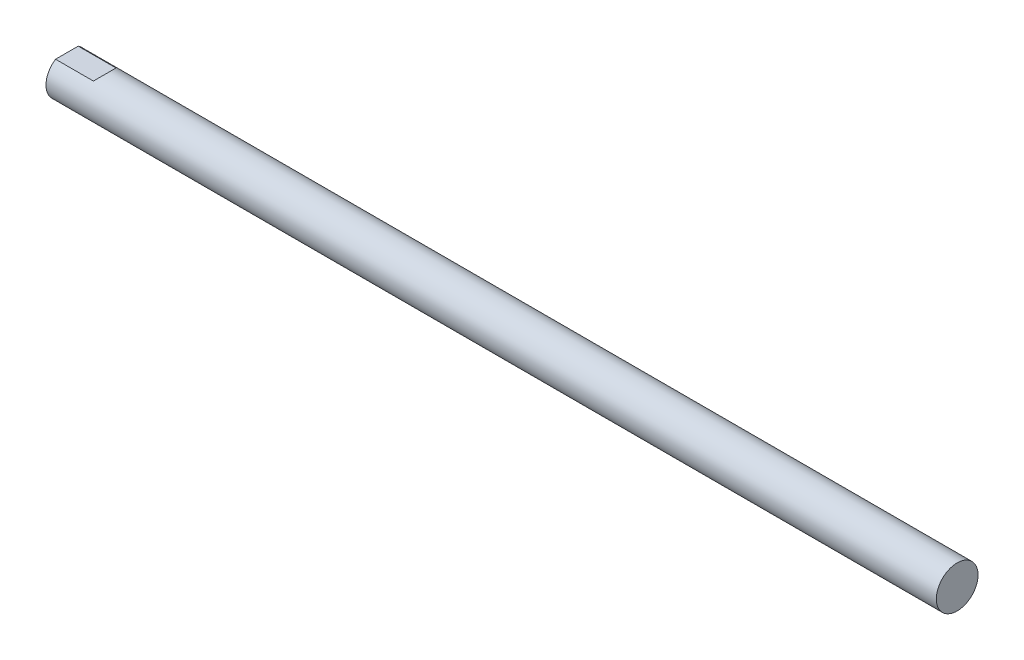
from build123d import *

# Parameters (mm, degrees)
SKETCH1_W                   = 406.4
SKETCH1_H                   = 9.525
F_3_8_16_TAPPED_HOLE1_D     = 7.9375
F_3_8_16_TAPPED_HOLE1_DEPTH = 27.0002
F_3_8_16_TAPPED_HOLE1_TIP   = 2.384665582
CUT_EXTRUDE1_DEPTH          = 407.623180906
CUT_EXTRUDE1_DEPTH_BACK     = 407.623180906


with BuildPart() as part:
    # Sketch1 → Revolve1 (revolve)
    with BuildSketch(Plane.XY, mode=Mode.PRIVATE) as revolve1_sk:
        with Locations((203.2, 4.7625)):
            Rectangle(SKETCH1_W, SKETCH1_H)
    revolve(revolve1_sk.sketch.rotate(Axis((-29.862162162, 0, 0), (1, 0, 0)), 90), axis=Axis((-29.862162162, 0, 0), (1, 0, 0)))

    # 3_8-16 Tapped Hole1
    with Locations(Plane.ZY):
        with Locations((0, 0)):
            Hole(F_3_8_16_TAPPED_HOLE1_D / 2, depth=F_3_8_16_TAPPED_HOLE1_DEPTH)
            with Locations((0, 0, -(F_3_8_16_TAPPED_HOLE1_DEPTH + F_3_8_16_TAPPED_HOLE1_TIP / 2))):  # 118° drill point
                Cone(0, F_3_8_16_TAPPED_HOLE1_D / 2, F_3_8_16_TAPPED_HOLE1_TIP, mode=Mode.SUBTRACT)

    # Sketch4 → Cut-Extrude1 (cut, two sides: drawn at the far end of the back side and taken through both)
    with BuildSketch(Plane.XY.offset(-CUT_EXTRUDE1_DEPTH_BACK)):
        Polygon((0, 8.001), (17.272, 8.001), (18.796, 9.525), (0, 9.525), align=None)
    extrude(amount=CUT_EXTRUDE1_DEPTH + CUT_EXTRUDE1_DEPTH_BACK, mode=Mode.SUBTRACT)


solid = part.part
